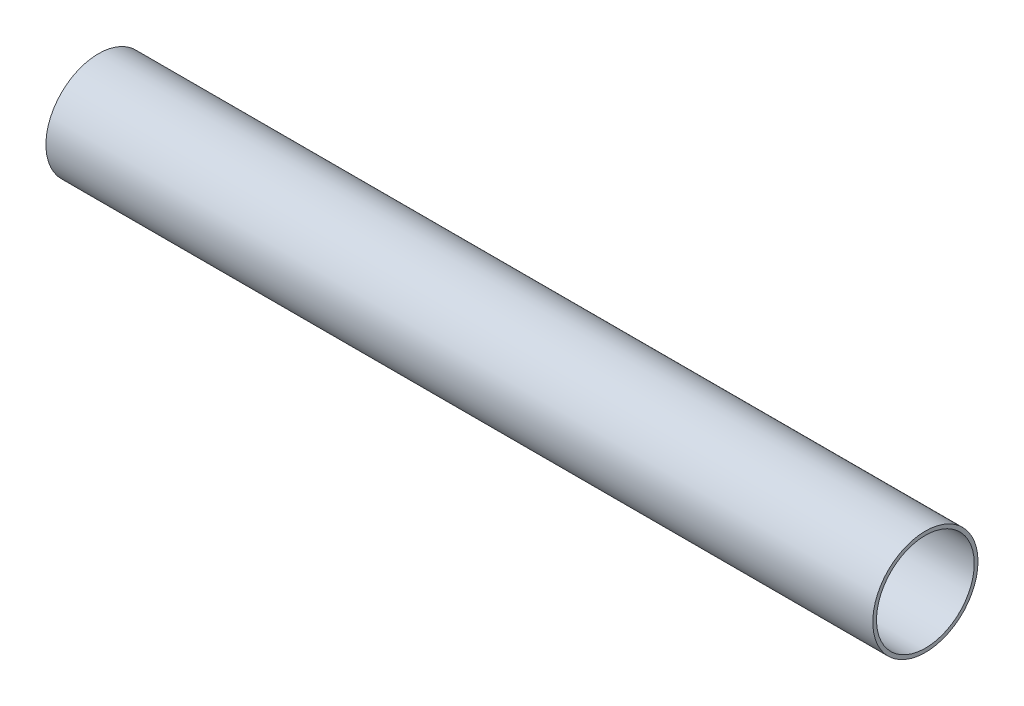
ISO-10303-21;
HEADER;
FILE_DESCRIPTION(('STEP AP214'),'2;1');
FILE_NAME('part.step','',(''),(''),'','','');
FILE_SCHEMA(('AUTOMOTIVE_DESIGN { 1 0 10303 214 1 1 1 1 }'));
ENDSEC;
DATA;
#1=APPLICATION_CONTEXT('core data for automotive mechanical design processes');
#2=APPLICATION_PROTOCOL_DEFINITION('international standard','automotive_design',2000,#1);
#3=PRODUCT_CONTEXT('',#1,'mechanical');
#4=PRODUCT('Part','Part','',(#3));
#5=PRODUCT_RELATED_PRODUCT_CATEGORY('part','',(#4));
#6=PRODUCT_DEFINITION_FORMATION('','',#4);
#7=PRODUCT_DEFINITION_CONTEXT('part definition',#1,'design');
#8=PRODUCT_DEFINITION('design','',#6,#7);
#9=PRODUCT_DEFINITION_SHAPE('','',#8);
#10=(LENGTH_UNIT() NAMED_UNIT(*) SI_UNIT(.MILLI.,.METRE.));
#11=(NAMED_UNIT(*) PLANE_ANGLE_UNIT() SI_UNIT($,.RADIAN.));
#12=(NAMED_UNIT(*) SI_UNIT($,.STERADIAN.) SOLID_ANGLE_UNIT());
#13=UNCERTAINTY_MEASURE_WITH_UNIT(LENGTH_MEASURE(1.E-05),#10,'distance_accuracy_value','');
#14=(GEOMETRIC_REPRESENTATION_CONTEXT(3) GLOBAL_UNCERTAINTY_ASSIGNED_CONTEXT((#13)) GLOBAL_UNIT_ASSIGNED_CONTEXT((#10,
#11,#12)) REPRESENTATION_CONTEXT('',''));
#15=CARTESIAN_POINT('',(0.,0.,0.));
#16=DIRECTION('',(0.,0.,1.));
#17=DIRECTION('',(1.,0.,0.));
#18=AXIS2_PLACEMENT_3D('',#15,#16,#17);
#19=CARTESIAN_POINT('',(-20.,10.5,0.));
#20=DIRECTION('',(-1.,0.,0.));
#21=DIRECTION('',(0.,0.,1.));
#22=AXIS2_PLACEMENT_3D('',#19,#20,#21);
#23=PLANE('',#22);
#24=CARTESIAN_POINT('',(-20.,0.,0.));
#25=DIRECTION('',(1.,0.,0.));
#26=DIRECTION('',(0.,0.,-1.));
#27=AXIS2_PLACEMENT_3D('',#24,#25,#26);
#28=CIRCLE('',#27,9.74999999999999);
#29=CARTESIAN_POINT('',(-20.,0.,-9.74999999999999));
#30=VERTEX_POINT('',#29);
#31=EDGE_CURVE('E10',#30,#30,#28,.T.);
#32=ORIENTED_EDGE('',*,*,#31,.T.);
#33=EDGE_LOOP('',(#32));
#34=FACE_BOUND('',#33,.T.);
#35=CARTESIAN_POINT('',(-20.,0.,0.));
#36=DIRECTION('',(1.,0.,0.));
#37=DIRECTION('',(0.,0.,-1.));
#38=AXIS2_PLACEMENT_3D('',#35,#36,#37);
#39=CIRCLE('',#38,10.5);
#40=CARTESIAN_POINT('',(-20.,0.,-10.5));
#41=VERTEX_POINT('',#40);
#42=EDGE_CURVE('E40',#41,#41,#39,.T.);
#43=ORIENTED_EDGE('',*,*,#42,.F.);
#44=EDGE_LOOP('',(#43));
#45=FACE_BOUND('',#44,.T.);
#46=ADVANCED_FACE('F26',(#34,#45),#23,.T.);
#47=CARTESIAN_POINT('',(40.,0.,0.));
#48=DIRECTION('',(1.,0.,0.));
#49=DIRECTION('',(0.,0.,-1.));
#50=AXIS2_PLACEMENT_3D('',#47,#48,#49);
#51=CYLINDRICAL_SURFACE('',#50,9.74999999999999);
#52=CARTESIAN_POINT('',(145.,0.,0.));
#53=DIRECTION('',(1.,0.,0.));
#54=DIRECTION('',(0.,0.,-1.));
#55=AXIS2_PLACEMENT_3D('',#52,#53,#54);
#56=CIRCLE('',#55,9.74999999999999);
#57=CARTESIAN_POINT('',(145.,0.,-9.74999999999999));
#58=VERTEX_POINT('',#57);
#59=EDGE_CURVE('E32',#58,#58,#56,.T.);
#60=ORIENTED_EDGE('',*,*,#59,.T.);
#61=EDGE_LOOP('',(#60));
#62=FACE_BOUND('',#61,.T.);
#63=ORIENTED_EDGE('',*,*,#31,.F.);
#64=EDGE_LOOP('',(#63));
#65=FACE_BOUND('',#64,.T.);
#66=ADVANCED_FACE('F50',(#62,#65),#51,.F.);
#67=CARTESIAN_POINT('',(145.,9.74999999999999,0.));
#68=DIRECTION('',(1.,0.,0.));
#69=DIRECTION('',(0.,0.,-1.));
#70=AXIS2_PLACEMENT_3D('',#67,#68,#69);
#71=PLANE('',#70);
#72=CARTESIAN_POINT('',(145.,0.,0.));
#73=DIRECTION('',(1.,0.,0.));
#74=DIRECTION('',(0.,0.,-1.));
#75=AXIS2_PLACEMENT_3D('',#72,#73,#74);
#76=CIRCLE('',#75,10.5);
#77=CARTESIAN_POINT('',(145.,0.,-10.5));
#78=VERTEX_POINT('',#77);
#79=EDGE_CURVE('E36',#78,#78,#76,.T.);
#80=ORIENTED_EDGE('',*,*,#79,.T.);
#81=EDGE_LOOP('',(#80));
#82=FACE_BOUND('',#81,.T.);
#83=ORIENTED_EDGE('',*,*,#59,.F.);
#84=EDGE_LOOP('',(#83));
#85=FACE_BOUND('',#84,.T.);
#86=ADVANCED_FACE('F54',(#82,#85),#71,.T.);
#87=CARTESIAN_POINT('',(40.,0.,0.));
#88=DIRECTION('',(1.,0.,0.));
#89=DIRECTION('',(0.,0.,-1.));
#90=AXIS2_PLACEMENT_3D('',#87,#88,#89);
#91=CYLINDRICAL_SURFACE('',#90,10.5);
#92=ORIENTED_EDGE('',*,*,#42,.T.);
#93=EDGE_LOOP('',(#92));
#94=FACE_BOUND('',#93,.T.);
#95=ORIENTED_EDGE('',*,*,#79,.F.);
#96=EDGE_LOOP('',(#95));
#97=FACE_BOUND('',#96,.T.);
#98=ADVANCED_FACE('F46',(#94,#97),#91,.T.);
#99=CLOSED_SHELL('',(#46,#66,#86,#98));
#100=MANIFOLD_SOLID_BREP('B2',#99);
#101=ADVANCED_BREP_SHAPE_REPRESENTATION('',(#18,#100),#14);
#102=SHAPE_DEFINITION_REPRESENTATION(#9,#101);
ENDSEC;
END-ISO-10303-21;
